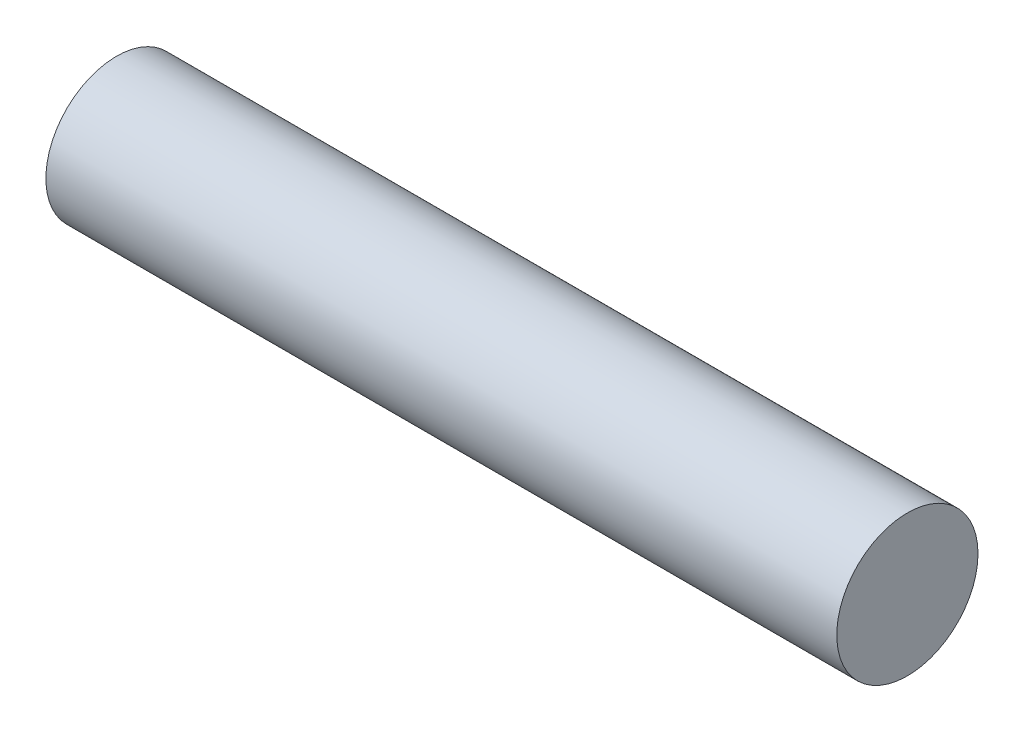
ISO-10303-21;
HEADER;
FILE_DESCRIPTION(('STEP AP214'),'2;1');
FILE_NAME('part.step','',(''),(''),'','','');
FILE_SCHEMA(('AUTOMOTIVE_DESIGN { 1 0 10303 214 1 1 1 1 }'));
ENDSEC;
DATA;
#1=APPLICATION_CONTEXT('core data for automotive mechanical design processes');
#2=APPLICATION_PROTOCOL_DEFINITION('international standard','automotive_design',2000,#1);
#3=PRODUCT_CONTEXT('',#1,'mechanical');
#4=PRODUCT('Part','Part','',(#3));
#5=PRODUCT_RELATED_PRODUCT_CATEGORY('part','',(#4));
#6=PRODUCT_DEFINITION_FORMATION('','',#4);
#7=PRODUCT_DEFINITION_CONTEXT('part definition',#1,'design');
#8=PRODUCT_DEFINITION('design','',#6,#7);
#9=PRODUCT_DEFINITION_SHAPE('','',#8);
#10=(LENGTH_UNIT() NAMED_UNIT(*) SI_UNIT(.MILLI.,.METRE.));
#11=(NAMED_UNIT(*) PLANE_ANGLE_UNIT() SI_UNIT($,.RADIAN.));
#12=(NAMED_UNIT(*) SI_UNIT($,.STERADIAN.) SOLID_ANGLE_UNIT());
#13=UNCERTAINTY_MEASURE_WITH_UNIT(LENGTH_MEASURE(1.E-05),#10,'distance_accuracy_value','');
#14=(GEOMETRIC_REPRESENTATION_CONTEXT(3) GLOBAL_UNCERTAINTY_ASSIGNED_CONTEXT((#13)) GLOBAL_UNIT_ASSIGNED_CONTEXT((#10,
#11,#12)) REPRESENTATION_CONTEXT('',''));
#15=CARTESIAN_POINT('',(0.,0.,0.));
#16=DIRECTION('',(0.,0.,1.));
#17=DIRECTION('',(1.,0.,0.));
#18=AXIS2_PLACEMENT_3D('',#15,#16,#17);
#19=CARTESIAN_POINT('',(28.,0.,0.));
#20=DIRECTION('',(-1.,0.,0.));
#21=DIRECTION('',(0.,0.,1.));
#22=AXIS2_PLACEMENT_3D('',#19,#20,#21);
#23=CYLINDRICAL_SURFACE('',#22,2.5);
#24=CARTESIAN_POINT('',(28.,0.,0.));
#25=DIRECTION('',(1.,0.,0.));
#26=DIRECTION('',(0.,0.,-1.));
#27=AXIS2_PLACEMENT_3D('',#24,#25,#26);
#28=CIRCLE('',#27,2.5);
#29=CARTESIAN_POINT('',(28.,0.,-2.5));
#30=VERTEX_POINT('',#29);
#31=EDGE_CURVE('E10',#30,#30,#28,.T.);
#32=ORIENTED_EDGE('',*,*,#31,.F.);
#33=EDGE_LOOP('',(#32));
#34=FACE_BOUND('',#33,.T.);
#35=CARTESIAN_POINT('',(0.,0.,0.));
#36=DIRECTION('',(1.,0.,0.));
#37=DIRECTION('',(0.,0.,-1.));
#38=AXIS2_PLACEMENT_3D('',#35,#36,#37);
#39=CIRCLE('',#38,2.5);
#40=CARTESIAN_POINT('',(0.,0.,-2.5));
#41=VERTEX_POINT('',#40);
#42=EDGE_CURVE('E36',#41,#41,#39,.T.);
#43=ORIENTED_EDGE('',*,*,#42,.T.);
#44=EDGE_LOOP('',(#43));
#45=FACE_BOUND('',#44,.T.);
#46=ADVANCED_FACE('F33',(#34,#45),#23,.T.);
#47=CARTESIAN_POINT('',(28.,0.,0.));
#48=DIRECTION('',(1.,0.,0.));
#49=DIRECTION('',(0.,0.,-1.));
#50=AXIS2_PLACEMENT_3D('',#47,#48,#49);
#51=PLANE('',#50);
#52=ORIENTED_EDGE('',*,*,#31,.T.);
#53=EDGE_LOOP('',(#52));
#54=FACE_BOUND('',#53,.T.);
#55=ADVANCED_FACE('F48',(#54),#51,.T.);
#56=CARTESIAN_POINT('',(0.,0.,0.));
#57=DIRECTION('',(1.,0.,0.));
#58=DIRECTION('',(0.,0.,-1.));
#59=AXIS2_PLACEMENT_3D('',#56,#57,#58);
#60=PLANE('',#59);
#61=ORIENTED_EDGE('',*,*,#42,.F.);
#62=EDGE_LOOP('',(#61));
#63=FACE_BOUND('',#62,.T.);
#64=ADVANCED_FACE('F46',(#63),#60,.F.);
#65=CLOSED_SHELL('',(#46,#55,#64));
#66=MANIFOLD_SOLID_BREP('B2',#65);
#67=ADVANCED_BREP_SHAPE_REPRESENTATION('',(#18,#66),#14);
#68=SHAPE_DEFINITION_REPRESENTATION(#9,#67);
ENDSEC;
END-ISO-10303-21;
